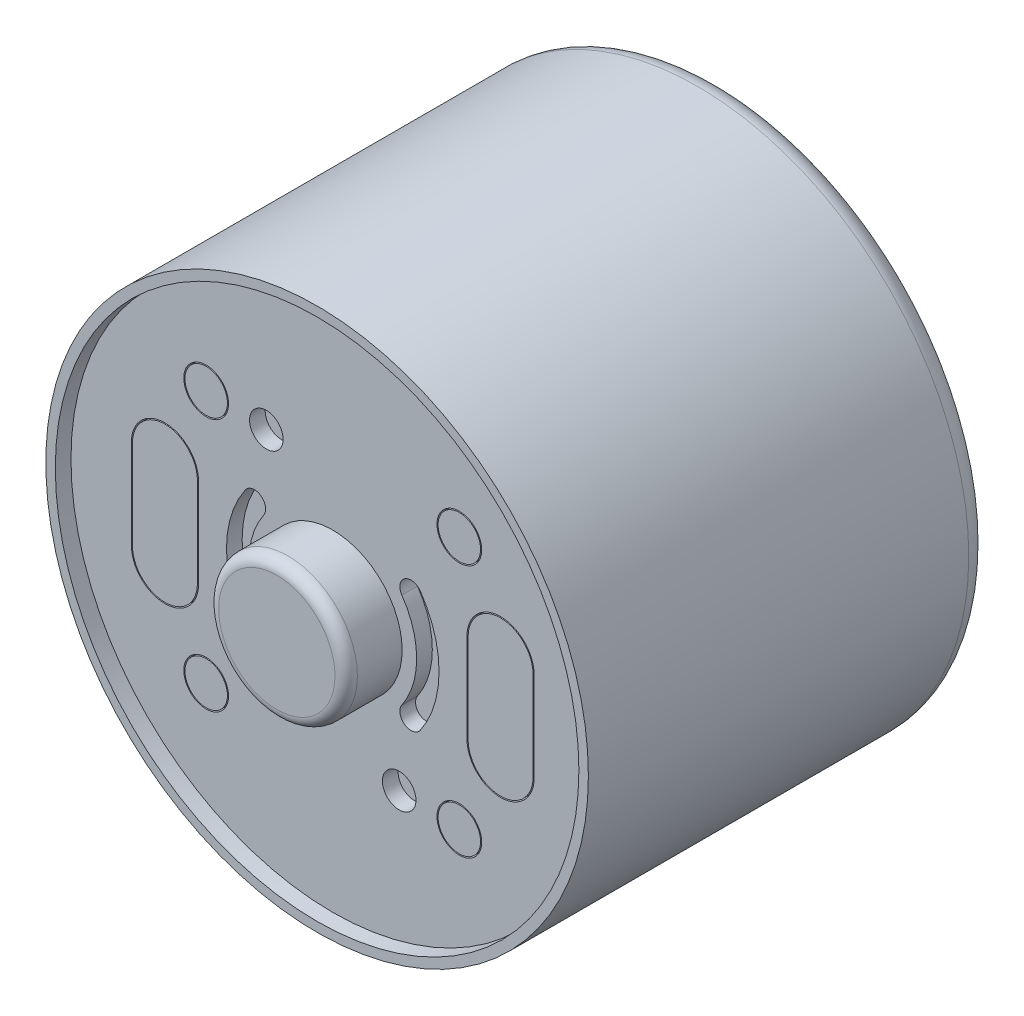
from build123d import *

# Parameters (mm, degrees)
ESQUISSE1_R             = 12.125
EXTRUSION1_DEPTH        = 18
ESQUISSE2_R             = 1
EXTRUSION2_DEPTH        = 7
CONG_1_R                = 1
CONG_2_R                = 0.2
ESQUISSE3_R             = 3.25
EXTRUSION3_DEPTH        = 0.5
ESQUISSE4_R             = 2.5
ESQUISSE4_R_2           = 2.45
ENL_V_MAT_EXTRU_1_DEPTH = 0.1
ESQUISSE5_R             = 11.7
ENL_V_MAT_EXTRU_2_DEPTH = 0.7
ESQUISSE6_R             = 0.75
ESQUISSE6_R_2           = 1
ESQUISSE6_R_3           = 0.95
ENL_V_MAT_EXTRU_3_DEPTH = 0.7
ESQUISSE7_R             = 3.1
EXTRUSION4_DEPTH        = 2.5
CONG_3_R                = 0.5


with BuildPart() as part:
    # Esquisse1 → Extrusion1 (new body)
    with BuildSketch(Plane.XY):
        Circle(ESQUISSE1_R)
    extrude(amount=-EXTRUSION1_DEPTH)

    # Esquisse2 → Extrusion2 (add)
    with BuildSketch(Plane(origin=(0, 0, -18), x_dir=(-1, 0, 0), z_dir=(0, 0, -1))):
        with Locations(Location((0, 0, 0), (0, 0, 180))):
            Circle(ESQUISSE2_R)
    extrude(amount=EXTRUSION2_DEPTH)

    # Cong_1
    cong_1_edges = [part.edges().sort_by_distance(p)[0] for p in [
        (-12.125, 0, -18),
    ]]
    fillet(cong_1_edges, radius=CONG_1_R)

    # Cong_2
    cong_2_edges = [part.edges().sort_by_distance(p)[0] for p in [
        (-1, 0, -25),
    ]]
    fillet(cong_2_edges, radius=CONG_2_R)

    # Esquisse3 → Extrusion3 (add)
    with BuildSketch(Plane(origin=(0, 0, -18), x_dir=(-1, 0, 0), z_dir=(0, 0, -1))):
        with Locations(Location((0, 0, 0), (0, 0, 180))):
            Circle(ESQUISSE3_R)
    extrude(amount=EXTRUSION3_DEPTH)

    # Esquisse4 → Enl_v. mat.-Extru.1 (cut)
    with BuildSketch(Plane(origin=(0, 0, -18.5), x_dir=(-1, 0, 0), z_dir=(0, 0, -1))):
        Circle(ESQUISSE4_R)
        Circle(ESQUISSE4_R_2, mode=Mode.SUBTRACT)
    extrude(amount=-ENL_V_MAT_EXTRU_1_DEPTH, mode=Mode.SUBTRACT)

    # Esquisse5 → Enl_v. mat.-Extru.2 (cut)
    with BuildSketch(Plane.XY):
        Circle(ESQUISSE5_R)
    extrude(amount=-ENL_V_MAT_EXTRU_2_DEPTH, mode=Mode.SUBTRACT)

    # Esquisse6 → Enl_v. mat.-Extru.3 (cut)
    # profile 1 of 10: a face of its own
    with BuildSketch(Plane.XY.offset(-0.7)):
        with Locations((-2.968585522, 5.5)):
            Circle(ESQUISSE6_R)
    # profile 2 of 10: a face of its own
    with BuildSketch(Plane.XY.offset(-0.7)):
        with Locations((2.968585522, -5.5)):
            Circle(ESQUISSE6_R)
    # profile 3 of 10: a face of its own
    with BuildSketch(Plane.XY.offset(-0.7)):
        with Locations((-5.656854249, 5.656854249)):
            Circle(ESQUISSE6_R_2)
        with Locations((-5.656854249, 5.656854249)):
            Circle(ESQUISSE6_R_3, mode=Mode.SUBTRACT)
    # profile 4 of 10: a face of its own
    with BuildSketch(Plane.XY.offset(-0.7)):
        with Locations((-5.656854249, -5.656854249)):
            Circle(ESQUISSE6_R_2)
        with Locations((-5.656854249, -5.656854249)):
            Circle(ESQUISSE6_R_3, mode=Mode.SUBTRACT)
    # profile 5 of 10: a face of its own
    with BuildSketch(Plane.XY.offset(-0.7)):
        with Locations((5.656854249, -5.656854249)):
            Circle(ESQUISSE6_R_2)
        with Locations((5.656854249, -5.656854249)):
            Circle(ESQUISSE6_R_3, mode=Mode.SUBTRACT)
    # profile 6 of 10: a face of its own
    with BuildSketch(Plane.XY.offset(-0.7)):
        with Locations((5.656854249, 5.656854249)):
            Circle(ESQUISSE6_R_2)
        with Locations((5.656854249, 5.656854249)):
            Circle(ESQUISSE6_R_3, mode=Mode.SUBTRACT)
    # profile 7 of 10: a face of its own
    with BuildSketch(Plane.XY.offset(-0.7)):
        with BuildLine():
            Line((-9, 2), (-9, -2))
            ThreePointArc((-9, -2), (-7.5, -3.5), (-6, -2))
            Line((-6, -2), (-6, 2))
            ThreePointArc((-6, 2), (-7.5, 3.5), (-9, 2))
        make_face()
        with BuildLine():
            Line((-8.95, 2), (-8.95, -2))
            ThreePointArc((-8.95, -2), (-7.5, -3.45), (-6.05, -2))
            Line((-6.05, -2), (-6.05, 2))
            ThreePointArc((-6.05, 2), (-7.5, 3.45), (-8.95, 2))
        make_face(mode=Mode.SUBTRACT)
    # profile 8 of 10: a face of its own
    with BuildSketch(Plane.XY.offset(-0.7)):
        with BuildLine():
            Line((6, 2), (6, -2))
            ThreePointArc((6, -2), (7.5, -3.5), (9, -2))
            Line((9, -2), (9, 2))
            ThreePointArc((9, 2), (7.5, 3.5), (6, 2))
        make_face()
        with BuildLine():
            Line((6.05, 2), (6.05, -2))
            ThreePointArc((6.05, -2), (7.5, -3.45), (8.95, -2))
            Line((8.95, -2), (8.95, 2))
            ThreePointArc((8.95, 2), (7.5, 3.45), (6.05, 2))
        make_face(mode=Mode.SUBTRACT)
    # profile 9 of 10: a face of its own
    with BuildSketch(Plane.XY.offset(-0.7)):
        with BuildLine():
            ThreePointArc((3.911764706, -2.694549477), (4.75, 0), (3.911764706, 2.694549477))
            ThreePointArc((3.911764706, 2.694549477), (3.216363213, 2.822677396), (3.088235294, 2.127275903))
            ThreePointArc((3.088235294, 2.127275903), (3.75, 0), (3.088235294, -2.127275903))
            ThreePointArc((3.088235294, -2.127275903), (3.216363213, -2.822677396), (3.911764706, -2.694549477))
        make_face()
    # profile 10 of 10: a face of its own
    with BuildSketch(Plane.XY.offset(-0.7)):
        with BuildLine():
            ThreePointArc((-3.088235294, 2.127275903), (-3.216363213, 2.822677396), (-3.911764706, 2.694549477))
            ThreePointArc((-3.911764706, 2.694549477), (-4.75, 0), (-3.911764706, -2.694549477))
            ThreePointArc((-3.911764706, -2.694549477), (-3.216363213, -2.822677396), (-3.088235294, -2.127275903))
            ThreePointArc((-3.088235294, -2.127275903), (-3.75, 0), (-3.088235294, 2.127275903))
        make_face()
    extrude(amount=-ENL_V_MAT_EXTRU_3_DEPTH, mode=Mode.SUBTRACT)

    # Esquisse7 → Extrusion4 (add)
    with BuildSketch(Plane.XY.offset(-0.7)):
        Circle(ESQUISSE7_R)
    extrude(amount=EXTRUSION4_DEPTH)

    # Cong_3
    cong_3_edges = [part.edges().sort_by_distance(p)[0] for p in [
        (-3.1, 0, 1.8),
    ]]
    fillet(cong_3_edges, radius=CONG_3_R)


solid = part.part
